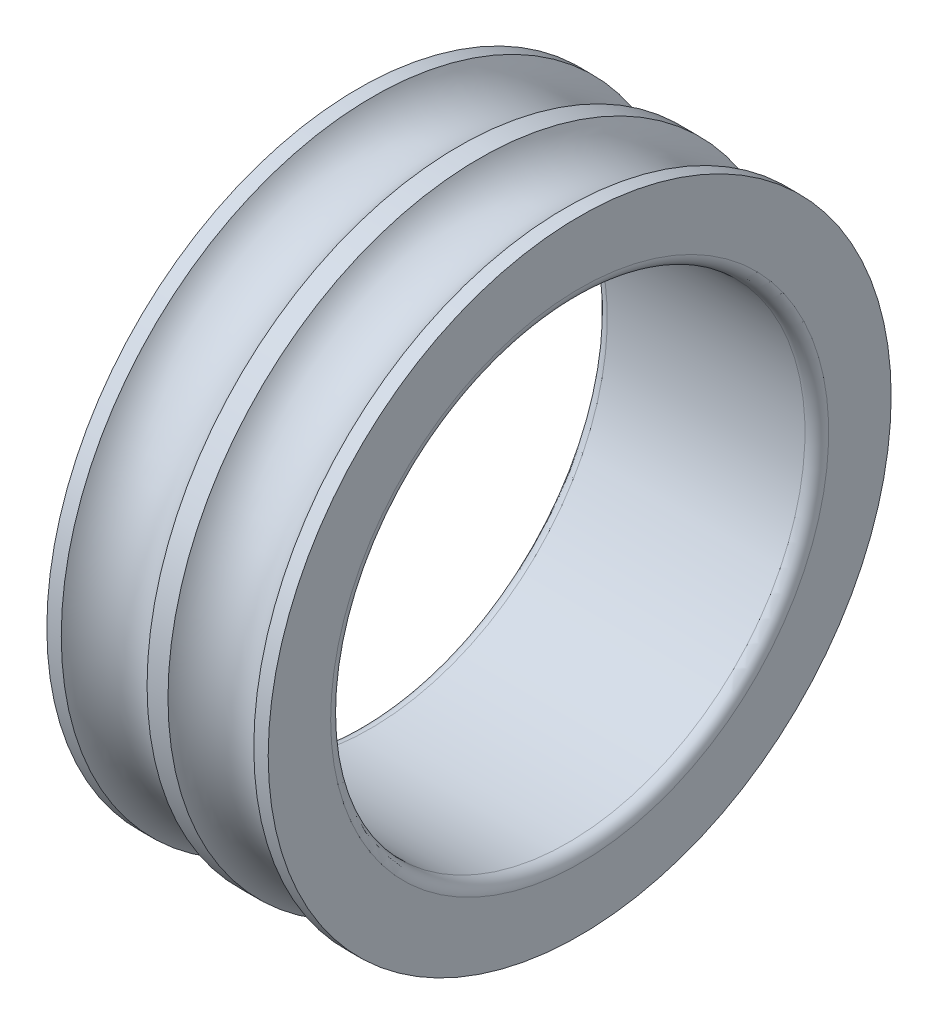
ISO-10303-21;
HEADER;
FILE_DESCRIPTION(('STEP AP214'),'2;1');
FILE_NAME('part.step','',(''),(''),'','','');
FILE_SCHEMA(('AUTOMOTIVE_DESIGN { 1 0 10303 214 1 1 1 1 }'));
ENDSEC;
DATA;
#1=APPLICATION_CONTEXT('core data for automotive mechanical design processes');
#2=APPLICATION_PROTOCOL_DEFINITION('international standard','automotive_design',2000,#1);
#3=PRODUCT_CONTEXT('',#1,'mechanical');
#4=PRODUCT('Part','Part','',(#3));
#5=PRODUCT_RELATED_PRODUCT_CATEGORY('part','',(#4));
#6=PRODUCT_DEFINITION_FORMATION('','',#4);
#7=PRODUCT_DEFINITION_CONTEXT('part definition',#1,'design');
#8=PRODUCT_DEFINITION('design','',#6,#7);
#9=PRODUCT_DEFINITION_SHAPE('','',#8);
#10=(LENGTH_UNIT() NAMED_UNIT(*) SI_UNIT(.MILLI.,.METRE.));
#11=(NAMED_UNIT(*) PLANE_ANGLE_UNIT() SI_UNIT($,.RADIAN.));
#12=(NAMED_UNIT(*) SI_UNIT($,.STERADIAN.) SOLID_ANGLE_UNIT());
#13=UNCERTAINTY_MEASURE_WITH_UNIT(LENGTH_MEASURE(1.E-05),#10,'distance_accuracy_value','');
#14=(GEOMETRIC_REPRESENTATION_CONTEXT(3) GLOBAL_UNCERTAINTY_ASSIGNED_CONTEXT((#13)) GLOBAL_UNIT_ASSIGNED_CONTEXT((#10,
#11,#12)) REPRESENTATION_CONTEXT('',''));
#15=CARTESIAN_POINT('',(0.,0.,0.));
#16=DIRECTION('',(0.,0.,1.));
#17=DIRECTION('',(1.,0.,0.));
#18=AXIS2_PLACEMENT_3D('',#15,#16,#17);
#19=CARTESIAN_POINT('',(1.5,0.,0.));
#20=DIRECTION('',(-1.,0.,0.));
#21=DIRECTION('',(0.,0.,1.));
#22=AXIS2_PLACEMENT_3D('',#19,#20,#21);
#23=TOROIDAL_SURFACE('',#22,31.5,1.5);
#24=CARTESIAN_POINT('',(1.5,0.,0.));
#25=DIRECTION('',(-1.,0.,0.));
#26=DIRECTION('',(0.,0.,1.));
#27=AXIS2_PLACEMENT_3D('',#24,#25,#26);
#28=CIRCLE('',#27,30.);
#29=CARTESIAN_POINT('',(1.5,0.,30.));
#30=VERTEX_POINT('',#29);
#31=EDGE_CURVE('E10',#30,#30,#28,.T.);
#32=ORIENTED_EDGE('',*,*,#31,.F.);
#33=EDGE_LOOP('',(#32));
#34=FACE_BOUND('',#33,.T.);
#35=CARTESIAN_POINT('',(0.,0.,0.));
#36=DIRECTION('',(-1.,0.,0.));
#37=DIRECTION('',(0.,0.,1.));
#38=AXIS2_PLACEMENT_3D('',#35,#36,#37);
#39=CIRCLE('',#38,31.5);
#40=CARTESIAN_POINT('',(0.,0.,31.5));
#41=VERTEX_POINT('',#40);
#42=EDGE_CURVE('E62',#41,#41,#39,.T.);
#43=ORIENTED_EDGE('',*,*,#42,.T.);
#44=EDGE_LOOP('',(#43));
#45=FACE_BOUND('',#44,.T.);
#46=ADVANCED_FACE('F28',(#34,#45),#23,.T.);
#47=CARTESIAN_POINT('',(0.,0.,0.));
#48=DIRECTION('',(-1.,0.,0.));
#49=DIRECTION('',(0.,0.,1.));
#50=AXIS2_PLACEMENT_3D('',#47,#48,#49);
#51=CYLINDRICAL_SURFACE('',#50,30.);
#52=CARTESIAN_POINT('',(26.5,0.,0.));
#53=DIRECTION('',(-1.,0.,0.));
#54=DIRECTION('',(0.,0.,1.));
#55=AXIS2_PLACEMENT_3D('',#52,#53,#54);
#56=CIRCLE('',#55,30.);
#57=CARTESIAN_POINT('',(26.5,0.,30.));
#58=VERTEX_POINT('',#57);
#59=EDGE_CURVE('E34',#58,#58,#56,.T.);
#60=ORIENTED_EDGE('',*,*,#59,.F.);
#61=EDGE_LOOP('',(#60));
#62=FACE_BOUND('',#61,.T.);
#63=ORIENTED_EDGE('',*,*,#31,.T.);
#64=EDGE_LOOP('',(#63));
#65=FACE_BOUND('',#64,.T.);
#66=ADVANCED_FACE('F111',(#62,#65),#51,.F.);
#67=CARTESIAN_POINT('',(26.5,0.,0.));
#68=DIRECTION('',(-1.,0.,0.));
#69=DIRECTION('',(0.,0.,1.));
#70=AXIS2_PLACEMENT_3D('',#67,#68,#69);
#71=TOROIDAL_SURFACE('',#70,31.5,1.5);
#72=CARTESIAN_POINT('',(28.,0.,0.));
#73=DIRECTION('',(-1.,0.,0.));
#74=DIRECTION('',(0.,0.,1.));
#75=AXIS2_PLACEMENT_3D('',#72,#73,#74);
#76=CIRCLE('',#75,31.5);
#77=CARTESIAN_POINT('',(28.,0.,31.5));
#78=VERTEX_POINT('',#77);
#79=EDGE_CURVE('E38',#78,#78,#76,.T.);
#80=ORIENTED_EDGE('',*,*,#79,.F.);
#81=EDGE_LOOP('',(#80));
#82=FACE_BOUND('',#81,.T.);
#83=ORIENTED_EDGE('',*,*,#59,.T.);
#84=EDGE_LOOP('',(#83));
#85=FACE_BOUND('',#84,.T.);
#86=ADVANCED_FACE('F106',(#82,#85),#71,.T.);
#87=CARTESIAN_POINT('',(28.,0.,-39.4));
#88=DIRECTION('',(-1.,0.,0.));
#89=DIRECTION('',(0.,0.,1.));
#90=AXIS2_PLACEMENT_3D('',#87,#88,#89);
#91=PLANE('',#90);
#92=CARTESIAN_POINT('',(28.,0.,0.));
#93=DIRECTION('',(-1.,0.,0.));
#94=DIRECTION('',(0.,0.,1.));
#95=AXIS2_PLACEMENT_3D('',#92,#93,#94);
#96=CIRCLE('',#95,39.4);
#97=CARTESIAN_POINT('',(28.,0.,39.4));
#98=VERTEX_POINT('',#97);
#99=EDGE_CURVE('E42',#98,#98,#96,.T.);
#100=ORIENTED_EDGE('',*,*,#99,.F.);
#101=EDGE_LOOP('',(#100));
#102=FACE_BOUND('',#101,.T.);
#103=ORIENTED_EDGE('',*,*,#79,.T.);
#104=EDGE_LOOP('',(#103));
#105=FACE_BOUND('',#104,.T.);
#106=ADVANCED_FACE('F100',(#102,#105),#91,.F.);
#107=CARTESIAN_POINT('',(0.,0.,0.));
#108=DIRECTION('',(-1.,0.,0.));
#109=DIRECTION('',(0.,0.,1.));
#110=AXIS2_PLACEMENT_3D('',#107,#108,#109);
#111=CYLINDRICAL_SURFACE('',#110,39.4);
#112=CARTESIAN_POINT('',(26.1770157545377,0.,0.));
#113=DIRECTION('',(-1.,0.,0.));
#114=DIRECTION('',(0.,0.,1.));
#115=AXIS2_PLACEMENT_3D('',#112,#113,#114);
#116=CIRCLE('',#115,39.4);
#117=CARTESIAN_POINT('',(26.1770157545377,0.,39.4));
#118=VERTEX_POINT('',#117);
#119=EDGE_CURVE('E47',#118,#118,#116,.T.);
#120=ORIENTED_EDGE('',*,*,#119,.F.);
#121=EDGE_LOOP('',(#120));
#122=FACE_BOUND('',#121,.T.);
#123=ORIENTED_EDGE('',*,*,#99,.T.);
#124=EDGE_LOOP('',(#123));
#125=FACE_BOUND('',#124,.T.);
#126=ADVANCED_FACE('F94',(#122,#125),#111,.T.);
#127=CARTESIAN_POINT('',(20.75,0.,0.));
#128=DIRECTION('',(-1.,0.,0.));
#129=DIRECTION('',(0.,0.,1.));
#130=AXIS2_PLACEMENT_3D('',#127,#128,#129);
#131=TOROIDAL_SURFACE('',#130,42.5,6.25);
#132=CARTESIAN_POINT('',(15.3229842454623,0.,0.));
#133=DIRECTION('',(-1.,0.,0.));
#134=DIRECTION('',(0.,0.,1.));
#135=AXIS2_PLACEMENT_3D('',#132,#133,#134);
#136=CIRCLE('',#135,39.4);
#137=CARTESIAN_POINT('',(15.3229842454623,0.,39.4));
#138=VERTEX_POINT('',#137);
#139=EDGE_CURVE('E50',#138,#138,#136,.T.);
#140=ORIENTED_EDGE('',*,*,#139,.F.);
#141=EDGE_LOOP('',(#140));
#142=FACE_BOUND('',#141,.T.);
#143=ORIENTED_EDGE('',*,*,#119,.T.);
#144=EDGE_LOOP('',(#143));
#145=FACE_BOUND('',#144,.T.);
#146=ADVANCED_FACE('F88',(#142,#145),#131,.F.);
#147=CARTESIAN_POINT('',(0.,0.,0.));
#148=DIRECTION('',(-1.,0.,0.));
#149=DIRECTION('',(0.,0.,1.));
#150=AXIS2_PLACEMENT_3D('',#147,#148,#149);
#151=CYLINDRICAL_SURFACE('',#150,39.4);
#152=CARTESIAN_POINT('',(12.6770157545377,0.,0.));
#153=DIRECTION('',(-1.,0.,0.));
#154=DIRECTION('',(0.,0.,1.));
#155=AXIS2_PLACEMENT_3D('',#152,#153,#154);
#156=CIRCLE('',#155,39.4);
#157=CARTESIAN_POINT('',(12.6770157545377,0.,39.4));
#158=VERTEX_POINT('',#157);
#159=EDGE_CURVE('E53',#158,#158,#156,.T.);
#160=ORIENTED_EDGE('',*,*,#159,.F.);
#161=EDGE_LOOP('',(#160));
#162=FACE_BOUND('',#161,.T.);
#163=ORIENTED_EDGE('',*,*,#139,.T.);
#164=EDGE_LOOP('',(#163));
#165=FACE_BOUND('',#164,.T.);
#166=ADVANCED_FACE('F82',(#162,#165),#151,.T.);
#167=CARTESIAN_POINT('',(7.25,0.,0.));
#168=DIRECTION('',(-1.,0.,0.));
#169=DIRECTION('',(0.,0.,1.));
#170=AXIS2_PLACEMENT_3D('',#167,#168,#169);
#171=TOROIDAL_SURFACE('',#170,42.5,6.25);
#172=CARTESIAN_POINT('',(1.82298424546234,0.,0.));
#173=DIRECTION('',(-1.,0.,0.));
#174=DIRECTION('',(0.,0.,1.));
#175=AXIS2_PLACEMENT_3D('',#172,#173,#174);
#176=CIRCLE('',#175,39.4);
#177=CARTESIAN_POINT('',(1.82298424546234,0.,39.4));
#178=VERTEX_POINT('',#177);
#179=EDGE_CURVE('E56',#178,#178,#176,.T.);
#180=ORIENTED_EDGE('',*,*,#179,.F.);
#181=EDGE_LOOP('',(#180));
#182=FACE_BOUND('',#181,.T.);
#183=ORIENTED_EDGE('',*,*,#159,.T.);
#184=EDGE_LOOP('',(#183));
#185=FACE_BOUND('',#184,.T.);
#186=ADVANCED_FACE('F76',(#182,#185),#171,.F.);
#187=CARTESIAN_POINT('',(0.,0.,0.));
#188=DIRECTION('',(-1.,0.,0.));
#189=DIRECTION('',(0.,0.,1.));
#190=AXIS2_PLACEMENT_3D('',#187,#188,#189);
#191=CYLINDRICAL_SURFACE('',#190,39.4);
#192=CARTESIAN_POINT('',(0.,0.,0.));
#193=DIRECTION('',(-1.,0.,0.));
#194=DIRECTION('',(0.,0.,1.));
#195=AXIS2_PLACEMENT_3D('',#192,#193,#194);
#196=CIRCLE('',#195,39.4);
#197=CARTESIAN_POINT('',(0.,0.,39.4));
#198=VERTEX_POINT('',#197);
#199=EDGE_CURVE('E59',#198,#198,#196,.T.);
#200=ORIENTED_EDGE('',*,*,#199,.F.);
#201=EDGE_LOOP('',(#200));
#202=FACE_BOUND('',#201,.T.);
#203=ORIENTED_EDGE('',*,*,#179,.T.);
#204=EDGE_LOOP('',(#203));
#205=FACE_BOUND('',#204,.T.);
#206=ADVANCED_FACE('F70',(#202,#205),#191,.T.);
#207=CARTESIAN_POINT('',(0.,0.,-39.4));
#208=DIRECTION('',(1.,0.,0.));
#209=DIRECTION('',(0.,0.,-1.));
#210=AXIS2_PLACEMENT_3D('',#207,#208,#209);
#211=PLANE('',#210);
#212=ORIENTED_EDGE('',*,*,#42,.F.);
#213=EDGE_LOOP('',(#212));
#214=FACE_BOUND('',#213,.T.);
#215=ORIENTED_EDGE('',*,*,#199,.T.);
#216=EDGE_LOOP('',(#215));
#217=FACE_BOUND('',#216,.T.);
#218=ADVANCED_FACE('F67',(#214,#217),#211,.F.);
#219=CLOSED_SHELL('',(#46,#66,#86,#106,#126,#146,#166,#186,#206,#218));
#220=MANIFOLD_SOLID_BREP('B2',#219);
#221=ADVANCED_BREP_SHAPE_REPRESENTATION('',(#18,#220),#14);
#222=SHAPE_DEFINITION_REPRESENTATION(#9,#221);
ENDSEC;
END-ISO-10303-21;
